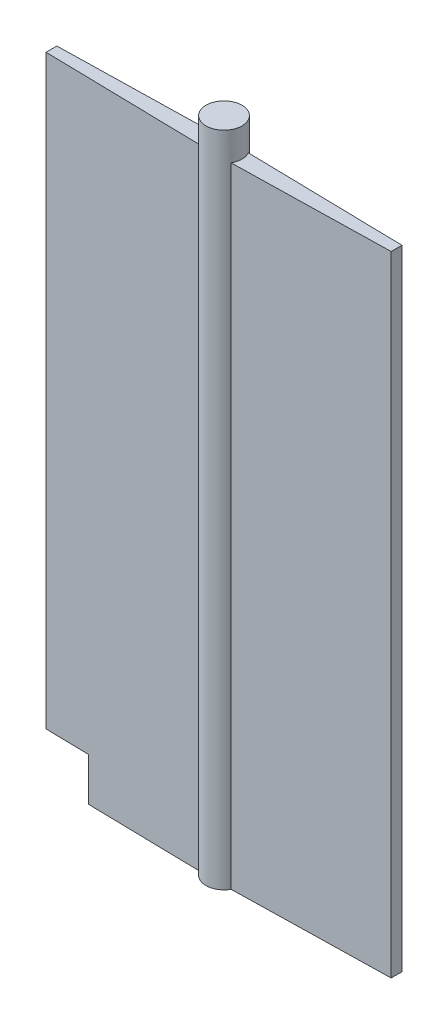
ISO-10303-21;
HEADER;
FILE_DESCRIPTION(('STEP AP214'),'2;1');
FILE_NAME('part.step','',(''),(''),'','','');
FILE_SCHEMA(('AUTOMOTIVE_DESIGN { 1 0 10303 214 1 1 1 1 }'));
ENDSEC;
DATA;
#1=APPLICATION_CONTEXT('core data for automotive mechanical design processes');
#2=APPLICATION_PROTOCOL_DEFINITION('international standard','automotive_design',2000,#1);
#3=PRODUCT_CONTEXT('',#1,'mechanical');
#4=PRODUCT('Part','Part','',(#3));
#5=PRODUCT_RELATED_PRODUCT_CATEGORY('part','',(#4));
#6=PRODUCT_DEFINITION_FORMATION('','',#4);
#7=PRODUCT_DEFINITION_CONTEXT('part definition',#1,'design');
#8=PRODUCT_DEFINITION('design','',#6,#7);
#9=PRODUCT_DEFINITION_SHAPE('','',#8);
#10=(LENGTH_UNIT() NAMED_UNIT(*) SI_UNIT(.MILLI.,.METRE.));
#11=(NAMED_UNIT(*) PLANE_ANGLE_UNIT() SI_UNIT($,.RADIAN.));
#12=(NAMED_UNIT(*) SI_UNIT($,.STERADIAN.) SOLID_ANGLE_UNIT());
#13=UNCERTAINTY_MEASURE_WITH_UNIT(LENGTH_MEASURE(1.E-05),#10,'distance_accuracy_value','');
#14=(GEOMETRIC_REPRESENTATION_CONTEXT(3) GLOBAL_UNCERTAINTY_ASSIGNED_CONTEXT((#13)) GLOBAL_UNIT_ASSIGNED_CONTEXT((#10,
#11,#12)) REPRESENTATION_CONTEXT('',''));
#15=CARTESIAN_POINT('',(0.,0.,0.));
#16=DIRECTION('',(0.,0.,1.));
#17=DIRECTION('',(1.,0.,0.));
#18=AXIS2_PLACEMENT_3D('',#15,#16,#17);
#19=CARTESIAN_POINT('',(0.,222.25,0.));
#20=DIRECTION('',(0.,1.,0.));
#21=DIRECTION('',(0.,0.,1.));
#22=AXIS2_PLACEMENT_3D('',#19,#20,#21);
#23=PLANE('',#22);
#24=CARTESIAN_POINT('',(0.,222.25,0.));
#25=DIRECTION('',(0.,1.,0.));
#26=DIRECTION('',(0.,0.,1.));
#27=AXIS2_PLACEMENT_3D('',#24,#25,#26);
#28=CIRCLE('',#27,6.35);
#29=CARTESIAN_POINT('',(5.56458295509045,222.25,3.05907118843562));
#30=VERTEX_POINT('',#29);
#31=CARTESIAN_POINT('',(5.56458295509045,222.25,-3.05907118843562));
#32=VERTEX_POINT('',#31);
#33=EDGE_CURVE('E175',#30,#32,#28,.T.);
#34=ORIENTED_EDGE('',*,*,#33,.F.);
#35=DIRECTION('',(-0.999783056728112,0.,0.0208288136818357));
#36=VECTOR('',#35,1.);
#37=CARTESIAN_POINT('',(0.066117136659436,222.25,3.17362255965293));
#38=LINE('',#37,#36);
#39=CARTESIAN_POINT('',(60.96,222.25,1.905));
#40=VERTEX_POINT('',#39);
#41=EDGE_CURVE('E221',#40,#30,#38,.T.);
#42=ORIENTED_EDGE('',*,*,#41,.F.);
#43=DIRECTION('',(0.,0.,1.));
#44=VECTOR('',#43,1.);
#45=CARTESIAN_POINT('',(60.96,222.25,0.));
#46=LINE('',#45,#44);
#47=CARTESIAN_POINT('',(60.96,222.25,-1.905));
#48=VERTEX_POINT('',#47);
#49=EDGE_CURVE('E226',#48,#40,#46,.T.);
#50=ORIENTED_EDGE('',*,*,#49,.F.);
#51=DIRECTION('',(0.999783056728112,0.,0.0208288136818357));
#52=VECTOR('',#51,1.);
#53=CARTESIAN_POINT('',(0.066117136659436,222.25,-3.17362255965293));
#54=LINE('',#53,#52);
#55=EDGE_CURVE('E217',#32,#48,#54,.T.);
#56=ORIENTED_EDGE('',*,*,#55,.F.);
#57=EDGE_LOOP('',(#34,#42,#50,#56));
#58=FACE_BOUND('',#57,.T.);
#59=ADVANCED_FACE('F69',(#58),#23,.T.);
#60=CARTESIAN_POINT('',(0.066117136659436,222.25,3.17362255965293));
#61=DIRECTION('',(0.0208288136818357,0.,0.999783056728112));
#62=DIRECTION('',(0.999783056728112,0.,-0.0208288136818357));
#63=AXIS2_PLACEMENT_3D('',#60,#61,#62);
#64=PLANE('',#63);
#65=DIRECTION('',(-0.999783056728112,0.,0.0208288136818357));
#66=VECTOR('',#65,1.);
#67=CARTESIAN_POINT('',(0.066117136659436,0.,3.17362255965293));
#68=LINE('',#67,#66);
#69=CARTESIAN_POINT('',(60.96,0.,1.905));
#70=VERTEX_POINT('',#69);
#71=CARTESIAN_POINT('',(5.56458295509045,0.,3.05907118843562));
#72=VERTEX_POINT('',#71);
#73=EDGE_CURVE('E162',#70,#72,#68,.T.);
#74=ORIENTED_EDGE('',*,*,#73,.F.);
#75=DIRECTION('',(0.,-1.,0.));
#76=VECTOR('',#75,1.);
#77=CARTESIAN_POINT('',(60.96,222.25,1.905));
#78=LINE('',#77,#76);
#79=EDGE_CURVE('E176',#40,#70,#78,.T.);
#80=ORIENTED_EDGE('',*,*,#79,.F.);
#81=ORIENTED_EDGE('',*,*,#41,.T.);
#82=DIRECTION('',(0.,-1.,0.));
#83=VECTOR('',#82,1.);
#84=CARTESIAN_POINT('',(5.56458295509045,222.25,3.05907118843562));
#85=LINE('',#84,#83);
#86=EDGE_CURVE('E173',#30,#72,#85,.T.);
#87=ORIENTED_EDGE('',*,*,#86,.T.);
#88=EDGE_LOOP('',(#74,#80,#81,#87));
#89=FACE_BOUND('',#88,.T.);
#90=ADVANCED_FACE('F232',(#89),#64,.T.);
#91=CARTESIAN_POINT('',(60.96,222.25,0.));
#92=DIRECTION('',(1.,0.,0.));
#93=DIRECTION('',(0.,0.,-1.));
#94=AXIS2_PLACEMENT_3D('',#91,#92,#93);
#95=PLANE('',#94);
#96=DIRECTION('',(0.,0.,1.));
#97=VECTOR('',#96,1.);
#98=CARTESIAN_POINT('',(60.96,0.,0.));
#99=LINE('',#98,#97);
#100=CARTESIAN_POINT('',(60.96,0.,-1.905));
#101=VERTEX_POINT('',#100);
#102=EDGE_CURVE('E222',#101,#70,#99,.T.);
#103=ORIENTED_EDGE('',*,*,#102,.F.);
#104=DIRECTION('',(0.,-1.,0.));
#105=VECTOR('',#104,1.);
#106=CARTESIAN_POINT('',(60.96,222.25,-1.905));
#107=LINE('',#106,#105);
#108=EDGE_CURVE('E214',#48,#101,#107,.T.);
#109=ORIENTED_EDGE('',*,*,#108,.F.);
#110=ORIENTED_EDGE('',*,*,#49,.T.);
#111=ORIENTED_EDGE('',*,*,#79,.T.);
#112=EDGE_LOOP('',(#103,#109,#110,#111));
#113=FACE_BOUND('',#112,.T.);
#114=ADVANCED_FACE('F239',(#113),#95,.T.);
#115=CARTESIAN_POINT('',(0.066117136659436,222.25,-3.17362255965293));
#116=DIRECTION('',(0.0208288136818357,0.,-0.999783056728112));
#117=DIRECTION('',(-0.999783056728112,0.,-0.0208288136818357));
#118=AXIS2_PLACEMENT_3D('',#115,#116,#117);
#119=PLANE('',#118);
#120=DIRECTION('',(0.999783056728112,0.,0.0208288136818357));
#121=VECTOR('',#120,1.);
#122=CARTESIAN_POINT('',(0.066117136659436,0.,-3.17362255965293));
#123=LINE('',#122,#121);
#124=CARTESIAN_POINT('',(5.56458295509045,0.,-3.05907118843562));
#125=VERTEX_POINT('',#124);
#126=EDGE_CURVE('E218',#125,#101,#123,.T.);
#127=ORIENTED_EDGE('',*,*,#126,.F.);
#128=DIRECTION('',(0.,-1.,0.));
#129=VECTOR('',#128,1.);
#130=CARTESIAN_POINT('',(5.56458295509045,222.25,-3.05907118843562));
#131=LINE('',#130,#129);
#132=EDGE_CURVE('E93',#32,#125,#131,.T.);
#133=ORIENTED_EDGE('',*,*,#132,.F.);
#134=ORIENTED_EDGE('',*,*,#55,.T.);
#135=ORIENTED_EDGE('',*,*,#108,.T.);
#136=EDGE_LOOP('',(#127,#133,#134,#135));
#137=FACE_BOUND('',#136,.T.);
#138=ADVANCED_FACE('F236',(#137),#119,.T.);
#139=CARTESIAN_POINT('',(0.,0.,0.));
#140=DIRECTION('',(0.,1.,0.));
#141=DIRECTION('',(0.,0.,1.));
#142=AXIS2_PLACEMENT_3D('',#139,#140,#141);
#143=PLANE('',#142);
#144=DIRECTION('',(0.999783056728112,0.,0.020828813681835));
#145=VECTOR('',#144,1.);
#146=CARTESIAN_POINT('',(-0.066117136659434,0.,3.17362255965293));
#147=LINE('',#146,#145);
#148=CARTESIAN_POINT('',(-45.72,0.,2.22250000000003));
#149=VERTEX_POINT('',#148);
#150=CARTESIAN_POINT('',(-5.56458295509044,0.,3.05907118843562));
#151=VERTEX_POINT('',#150);
#152=EDGE_CURVE('E131',#149,#151,#147,.T.);
#153=ORIENTED_EDGE('',*,*,#152,.F.);
#154=DIRECTION('',(0.,0.,1.));
#155=VECTOR('',#154,1.);
#156=CARTESIAN_POINT('',(-45.72,0.,-6.35));
#157=LINE('',#156,#155);
#158=CARTESIAN_POINT('',(-45.72,0.,-2.22249999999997));
#159=VERTEX_POINT('',#158);
#160=EDGE_CURVE('E190',#159,#149,#157,.T.);
#161=ORIENTED_EDGE('',*,*,#160,.F.);
#162=DIRECTION('',(-0.999783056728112,0.,0.0208288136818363));
#163=VECTOR('',#162,1.);
#164=CARTESIAN_POINT('',(-0.0661171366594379,0.,-3.17362255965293));
#165=LINE('',#164,#163);
#166=CARTESIAN_POINT('',(-5.56458295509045,0.,-3.05907118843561));
#167=VERTEX_POINT('',#166);
#168=EDGE_CURVE('E145',#167,#159,#165,.T.);
#169=ORIENTED_EDGE('',*,*,#168,.F.);
#170=CARTESIAN_POINT('',(0.,0.,0.));
#171=DIRECTION('',(0.,1.,0.));
#172=DIRECTION('',(0.,0.,1.));
#173=AXIS2_PLACEMENT_3D('',#170,#171,#172);
#174=CIRCLE('',#173,6.35);
#175=EDGE_CURVE('E163',#125,#167,#174,.T.);
#176=ORIENTED_EDGE('',*,*,#175,.F.);
#177=ORIENTED_EDGE('',*,*,#126,.T.);
#178=ORIENTED_EDGE('',*,*,#102,.T.);
#179=ORIENTED_EDGE('',*,*,#73,.T.);
#180=EDGE_CURVE('E152',#151,#72,#174,.T.);
#181=ORIENTED_EDGE('',*,*,#180,.F.);
#182=EDGE_LOOP('',(#153,#161,#169,#176,#177,#178,#179,#181));
#183=FACE_BOUND('',#182,.T.);
#184=ADVANCED_FACE('F159',(#183),#143,.F.);
#185=CARTESIAN_POINT('',(-5.56458295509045,222.25,-3.05907118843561));
#186=VERTEX_POINT('',#185);
#187=CARTESIAN_POINT('',(-5.56458295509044,222.25,3.05907118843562));
#188=VERTEX_POINT('',#187);
#189=EDGE_CURVE('E155',#186,#188,#28,.T.);
#190=ORIENTED_EDGE('',*,*,#189,.F.);
#191=DIRECTION('',(-0.999783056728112,0.,0.0208288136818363));
#192=VECTOR('',#191,1.);
#193=CARTESIAN_POINT('',(-0.0661171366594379,222.25,-3.17362255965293));
#194=LINE('',#193,#192);
#195=CARTESIAN_POINT('',(-60.96,222.25,-1.90499999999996));
#196=VERTEX_POINT('',#195);
#197=EDGE_CURVE('E144',#186,#196,#194,.T.);
#198=ORIENTED_EDGE('',*,*,#197,.T.);
#199=DIRECTION('',(0.,0.,1.));
#200=VECTOR('',#199,1.);
#201=CARTESIAN_POINT('',(-60.96,222.25,0.));
#202=LINE('',#201,#200);
#203=CARTESIAN_POINT('',(-60.96,222.25,1.90500000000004));
#204=VERTEX_POINT('',#203);
#205=EDGE_CURVE('E210',#196,#204,#202,.T.);
#206=ORIENTED_EDGE('',*,*,#205,.T.);
#207=DIRECTION('',(0.999783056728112,0.,0.020828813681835));
#208=VECTOR('',#207,1.);
#209=CARTESIAN_POINT('',(-0.066117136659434,222.25,3.17362255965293));
#210=LINE('',#209,#208);
#211=EDGE_CURVE('E157',#204,#188,#210,.T.);
#212=ORIENTED_EDGE('',*,*,#211,.T.);
#213=EDGE_LOOP('',(#190,#198,#206,#212));
#214=FACE_BOUND('',#213,.T.);
#215=ADVANCED_FACE('F247',(#214),#23,.T.);
#216=CARTESIAN_POINT('',(-60.96,222.25,0.));
#217=DIRECTION('',(1.,0.,0.));
#218=DIRECTION('',(0.,0.,-1.));
#219=AXIS2_PLACEMENT_3D('',#216,#217,#218);
#220=PLANE('',#219);
#221=DIRECTION('',(0.,-1.,0.));
#222=VECTOR('',#221,1.);
#223=CARTESIAN_POINT('',(-60.96,222.25,-1.90499999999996));
#224=LINE('',#223,#222);
#225=CARTESIAN_POINT('',(-60.96,15.24,-1.90499999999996));
#226=VERTEX_POINT('',#225);
#227=EDGE_CURVE('E204',#196,#226,#224,.T.);
#228=ORIENTED_EDGE('',*,*,#227,.T.);
#229=DIRECTION('',(0.,0.,1.));
#230=VECTOR('',#229,1.);
#231=CARTESIAN_POINT('',(-60.96,15.24,-6.35));
#232=LINE('',#231,#230);
#233=CARTESIAN_POINT('',(-60.96,15.24,1.90500000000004));
#234=VERTEX_POINT('',#233);
#235=EDGE_CURVE('E187',#226,#234,#232,.T.);
#236=ORIENTED_EDGE('',*,*,#235,.T.);
#237=DIRECTION('',(0.,-1.,0.));
#238=VECTOR('',#237,1.);
#239=CARTESIAN_POINT('',(-60.96,222.25,1.90500000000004));
#240=LINE('',#239,#238);
#241=EDGE_CURVE('E156',#204,#234,#240,.T.);
#242=ORIENTED_EDGE('',*,*,#241,.F.);
#243=ORIENTED_EDGE('',*,*,#205,.F.);
#244=EDGE_LOOP('',(#228,#236,#242,#243));
#245=FACE_BOUND('',#244,.T.);
#246=ADVANCED_FACE('F200',(#245),#220,.F.);
#247=CARTESIAN_POINT('',(-0.066117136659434,222.25,3.17362255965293));
#248=DIRECTION('',(0.020828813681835,0.,-0.999783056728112));
#249=DIRECTION('',(-0.999783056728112,0.,-0.020828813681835));
#250=AXIS2_PLACEMENT_3D('',#247,#248,#249);
#251=PLANE('',#250);
#252=ORIENTED_EDGE('',*,*,#241,.T.);
#253=DIRECTION('',(0.999783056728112,0.,0.020828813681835));
#254=VECTOR('',#253,1.);
#255=CARTESIAN_POINT('',(-0.066117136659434,15.24,3.17362255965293));
#256=LINE('',#255,#254);
#257=CARTESIAN_POINT('',(-45.72,15.24,2.22250000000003));
#258=VERTEX_POINT('',#257);
#259=EDGE_CURVE('E181',#234,#258,#256,.T.);
#260=ORIENTED_EDGE('',*,*,#259,.T.);
#261=DIRECTION('',(0.,-1.,0.));
#262=VECTOR('',#261,1.);
#263=CARTESIAN_POINT('',(-45.72,222.25,2.22250000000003));
#264=LINE('',#263,#262);
#265=EDGE_CURVE('E140',#258,#149,#264,.T.);
#266=ORIENTED_EDGE('',*,*,#265,.T.);
#267=ORIENTED_EDGE('',*,*,#152,.T.);
#268=DIRECTION('',(0.,-1.,0.));
#269=VECTOR('',#268,1.);
#270=CARTESIAN_POINT('',(-5.56458295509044,222.25,3.05907118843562));
#271=LINE('',#270,#269);
#272=EDGE_CURVE('E136',#188,#151,#271,.T.);
#273=ORIENTED_EDGE('',*,*,#272,.F.);
#274=ORIENTED_EDGE('',*,*,#211,.F.);
#275=EDGE_LOOP('',(#252,#260,#266,#267,#273,#274));
#276=FACE_BOUND('',#275,.T.);
#277=ADVANCED_FACE('F134',(#276),#251,.F.);
#278=CARTESIAN_POINT('',(-0.0661171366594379,222.25,-3.17362255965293));
#279=DIRECTION('',(0.0208288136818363,0.,0.999783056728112));
#280=DIRECTION('',(0.999783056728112,0.,-0.0208288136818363));
#281=AXIS2_PLACEMENT_3D('',#278,#279,#280);
#282=PLANE('',#281);
#283=DIRECTION('',(0.,1.,0.));
#284=VECTOR('',#283,1.);
#285=CARTESIAN_POINT('',(-45.72,222.25,-2.22249999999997));
#286=LINE('',#285,#284);
#287=CARTESIAN_POINT('',(-45.72,15.24,-2.22249999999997));
#288=VERTEX_POINT('',#287);
#289=EDGE_CURVE('E77',#159,#288,#286,.T.);
#290=ORIENTED_EDGE('',*,*,#289,.T.);
#291=DIRECTION('',(-0.999783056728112,0.,0.0208288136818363));
#292=VECTOR('',#291,1.);
#293=CARTESIAN_POINT('',(-0.0661171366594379,15.24,-3.17362255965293));
#294=LINE('',#293,#292);
#295=EDGE_CURVE('E12',#288,#226,#294,.T.);
#296=ORIENTED_EDGE('',*,*,#295,.T.);
#297=ORIENTED_EDGE('',*,*,#227,.F.);
#298=ORIENTED_EDGE('',*,*,#197,.F.);
#299=DIRECTION('',(0.,-1.,0.));
#300=VECTOR('',#299,1.);
#301=CARTESIAN_POINT('',(-5.56458295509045,222.25,-3.05907118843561));
#302=LINE('',#301,#300);
#303=EDGE_CURVE('E169',#186,#167,#302,.T.);
#304=ORIENTED_EDGE('',*,*,#303,.T.);
#305=ORIENTED_EDGE('',*,*,#168,.T.);
#306=EDGE_LOOP('',(#290,#296,#297,#298,#304,#305));
#307=FACE_BOUND('',#306,.T.);
#308=ADVANCED_FACE('F244',(#307),#282,.F.);
#309=CARTESIAN_POINT('',(0.,222.25,0.));
#310=DIRECTION('',(0.,-1.,0.));
#311=DIRECTION('',(0.,0.,-1.));
#312=AXIS2_PLACEMENT_3D('',#309,#310,#311);
#313=CYLINDRICAL_SURFACE('',#312,6.35);
#314=ORIENTED_EDGE('',*,*,#86,.F.);
#315=ORIENTED_EDGE('',*,*,#33,.T.);
#316=ORIENTED_EDGE('',*,*,#132,.T.);
#317=ORIENTED_EDGE('',*,*,#175,.T.);
#318=ORIENTED_EDGE('',*,*,#303,.F.);
#319=ORIENTED_EDGE('',*,*,#189,.T.);
#320=ORIENTED_EDGE('',*,*,#272,.T.);
#321=ORIENTED_EDGE('',*,*,#180,.T.);
#322=EDGE_LOOP('',(#314,#315,#316,#317,#318,#319,#320,#321));
#323=FACE_BOUND('',#322,.T.);
#324=CARTESIAN_POINT('',(0.,232.41,0.));
#325=DIRECTION('',(0.,1.,0.));
#326=DIRECTION('',(0.,0.,1.));
#327=AXIS2_PLACEMENT_3D('',#324,#325,#326);
#328=CIRCLE('',#327,6.35);
#329=CARTESIAN_POINT('',(0.,232.41,6.35));
#330=VERTEX_POINT('',#329);
#331=EDGE_CURVE('E167',#330,#330,#328,.T.);
#332=ORIENTED_EDGE('',*,*,#331,.F.);
#333=EDGE_LOOP('',(#332));
#334=FACE_BOUND('',#333,.T.);
#335=ADVANCED_FACE('F71',(#323,#334),#313,.T.);
#336=CARTESIAN_POINT('',(0.,232.41,0.));
#337=DIRECTION('',(0.,1.,0.));
#338=DIRECTION('',(0.,0.,1.));
#339=AXIS2_PLACEMENT_3D('',#336,#337,#338);
#340=PLANE('',#339);
#341=ORIENTED_EDGE('',*,*,#331,.T.);
#342=EDGE_LOOP('',(#341));
#343=FACE_BOUND('',#342,.T.);
#344=ADVANCED_FACE('F259',(#343),#340,.T.);
#345=CARTESIAN_POINT('',(-60.96,15.24,-6.35));
#346=DIRECTION('',(0.,1.,0.));
#347=DIRECTION('',(0.,0.,1.));
#348=AXIS2_PLACEMENT_3D('',#345,#346,#347);
#349=PLANE('',#348);
#350=ORIENTED_EDGE('',*,*,#235,.F.);
#351=ORIENTED_EDGE('',*,*,#295,.F.);
#352=DIRECTION('',(0.,0.,1.));
#353=VECTOR('',#352,1.);
#354=CARTESIAN_POINT('',(-45.72,15.24,-6.35));
#355=LINE('',#354,#353);
#356=EDGE_CURVE('E84',#288,#258,#355,.T.);
#357=ORIENTED_EDGE('',*,*,#356,.T.);
#358=ORIENTED_EDGE('',*,*,#259,.F.);
#359=EDGE_LOOP('',(#350,#351,#357,#358));
#360=FACE_BOUND('',#359,.T.);
#361=ADVANCED_FACE('F264',(#360),#349,.F.);
#362=CARTESIAN_POINT('',(-45.72,0.,-6.35));
#363=DIRECTION('',(1.,0.,0.));
#364=DIRECTION('',(0.,0.,-1.));
#365=AXIS2_PLACEMENT_3D('',#362,#363,#364);
#366=PLANE('',#365);
#367=ORIENTED_EDGE('',*,*,#356,.F.);
#368=ORIENTED_EDGE('',*,*,#289,.F.);
#369=ORIENTED_EDGE('',*,*,#160,.T.);
#370=ORIENTED_EDGE('',*,*,#265,.F.);
#371=EDGE_LOOP('',(#367,#368,#369,#370));
#372=FACE_BOUND('',#371,.T.);
#373=ADVANCED_FACE('F315',(#372),#366,.F.);
#374=CLOSED_SHELL('',(#59,#90,#114,#138,#184,#215,#246,#277,#308,#335,#344,#361,#373));
#375=MANIFOLD_SOLID_BREP('B2',#374);
#376=ADVANCED_BREP_SHAPE_REPRESENTATION('',(#18,#375),#14);
#377=SHAPE_DEFINITION_REPRESENTATION(#9,#376);
ENDSEC;
END-ISO-10303-21;
